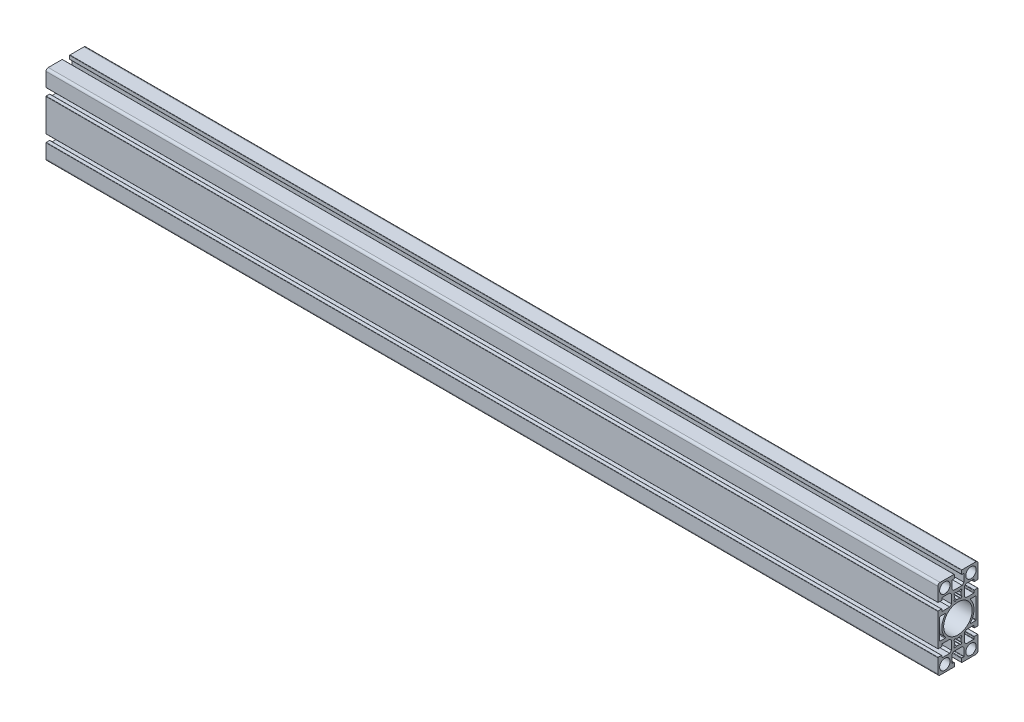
from build123d import *

# Parameters (mm, degrees)
MODEL6_R                                = 5.849999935
MODEL6_R_2                              = 15.999999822
F_45_SARJA_1_0109_45X90_VAHVA_L_1_DEPTH = 1000


with BuildPart() as part:
    # Model6 → 45-sarja 1.0109 45X90 VAHVA L_1 (new body)
    with BuildSketch(Plane(origin=(0, 0, 0), x_dir=(0, 0, -1), z_dir=(1, 0, 0))):
        with BuildLine():
            Line((4.599999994, 40.500001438), (6.499998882, 40.500001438))
            ThreePointArc((6.499998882, 40.500001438), (6.712130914, 40.412133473), (6.799998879, 40.200001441))
            Line((6.799998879, 40.200001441), (6.799998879, 31.699998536))
            Line((6.799998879, 31.699998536), (4.799998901, 29.699998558))
            Line((4.799998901, 29.699998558), (-4.799998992, 29.699998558))
            Line((-4.799998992, 29.699998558), (-6.79999997, 31.699998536))
            Line((-6.79999997, 31.699998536), (-6.79999997, 40.200001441))
            ThreePointArc((-6.79999997, 40.200001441), (-6.712132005, 40.412133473), (-6.499999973, 40.500001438))
            Line((-6.499999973, 40.500001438), (-4.599999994, 40.500001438))
            ThreePointArc((-4.599999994, 40.500001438), (-4.246446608, 40.646448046), (-4.1, 41.000001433))
            Line((-4.1, 41.000001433), (-4.1, 44.700001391))
            ThreePointArc((-4.1, 44.700001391), (-4.187867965, 44.912133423), (-4.399999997, 45.000001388))
            Line((-4.399999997, 45.000001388), (-20.000000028, 45.000001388))
            ThreePointArc((-20.000000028, 45.000001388), (-21.767766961, 44.267768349), (-22.5, 42.500001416))
            Line((-22.5, 42.500001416), (-22.5, 26.900001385))
            ThreePointArc((-22.5, 26.900001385), (-22.412132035, 26.687869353), (-22.200000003, 26.600001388))
            Line((-22.200000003, 26.600001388), (-18.500000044, 26.600001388))
            ThreePointArc((-18.500000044, 26.600001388), (-18.146446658, 26.746447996), (-18.00000005, 27.100001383))
            Line((-18.00000005, 27.100001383), (-18.00000005, 29.00000327))
            ThreePointArc((-18.00000005, 29.00000327), (-17.912132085, 29.212135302), (-17.700000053, 29.300003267))
            Line((-17.700000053, 29.300003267), (-9.200000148, 29.300003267))
            Line((-9.200000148, 29.300003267), (-7.20000017, 27.300003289))
            Line((-7.20000017, 27.300003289), (-7.20000017, 17.700001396))
            Line((-7.20000017, 17.700001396), (-9.200000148, 15.700001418))
            Line((-9.200000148, 15.700001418), (-17.700000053, 15.700001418))
            ThreePointArc((-17.700000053, 15.700001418), (-17.912132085, 15.787869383), (-18.00000005, 16.000001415))
            Line((-18.00000005, 16.000001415), (-18.00000005, 17.900001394))
            ThreePointArc((-18.00000005, 17.900001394), (-18.146446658, 18.25355478), (-18.500000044, 18.400001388))
            Line((-18.500000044, 18.400001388), (-22.200000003, 18.400001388))
            ThreePointArc((-22.200000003, 18.400001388), (-22.412132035, 18.312133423), (-22.5, 18.100001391))
            Line((-22.5, 18.100001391), (-22.5, -18.099998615))
            ThreePointArc((-22.5, -18.099998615), (-22.412132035, -18.312130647), (-22.200000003, -18.399998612))
            Line((-22.200000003, -18.399998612), (-18.500000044, -18.399998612))
            ThreePointArc((-18.500000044, -18.399998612), (-18.146446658, -18.253552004), (-18.00000005, -17.899998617))
            Line((-18.00000005, -17.899998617), (-18.00000005, -15.99999973))
            ThreePointArc((-18.00000005, -15.99999973), (-17.912132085, -15.787867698), (-17.700000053, -15.699999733))
            Line((-17.700000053, -15.699999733), (-9.200000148, -15.699999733))
            Line((-9.200000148, -15.699999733), (-7.20000017, -17.699999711))
            Line((-7.20000017, -17.699999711), (-7.20000017, -27.299997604))
            Line((-7.20000017, -27.299997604), (-9.200000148, -29.299998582))
            Line((-9.200000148, -29.299998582), (-17.700000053, -29.299998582))
            ThreePointArc((-17.700000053, -29.299998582), (-17.912132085, -29.212130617), (-18.00000005, -28.999998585))
            Line((-18.00000005, -28.999998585), (-18.00000005, -27.099998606))
            ThreePointArc((-18.00000005, -27.099998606), (-18.146446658, -26.74644522), (-18.500000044, -26.599998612))
            Line((-18.500000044, -26.599998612), (-22.200000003, -26.599998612))
            ThreePointArc((-22.200000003, -26.599998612), (-22.412132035, -26.687866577), (-22.5, -26.899998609))
            Line((-22.5, -26.899998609), (-22.5, -42.49999864))
            ThreePointArc((-22.5, -42.49999864), (-21.767766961, -44.267765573), (-20.000000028, -44.999998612))
            Line((-20.000000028, -44.999998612), (-4.399999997, -44.999998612))
            ThreePointArc((-4.399999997, -44.999998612), (-4.187867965, -44.912130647), (-4.1, -44.699998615))
            Line((-4.1, -44.699998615), (-4.1, -40.999998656))
            ThreePointArc((-4.1, -40.999998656), (-4.246446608, -40.64644527), (-4.599999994, -40.499998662))
            Line((-4.599999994, -40.499998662), (-6.499999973, -40.499998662))
            ThreePointArc((-6.499999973, -40.499998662), (-6.712132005, -40.412130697), (-6.79999997, -40.199998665))
            Line((-6.79999997, -40.199998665), (-6.79999997, -31.69999876))
            Line((-6.79999997, -31.69999876), (-4.799998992, -29.699998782))
            Line((-4.799998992, -29.699998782), (4.799998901, -29.699998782))
            Line((4.799998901, -29.699998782), (6.799998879, -31.69999876))
            Line((6.799998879, -31.69999876), (6.799998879, -40.199998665))
            ThreePointArc((6.799998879, -40.199998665), (6.712130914, -40.412130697), (6.499998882, -40.499998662))
            Line((6.499998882, -40.499998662), (4.599999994, -40.499998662))
            ThreePointArc((4.599999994, -40.499998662), (4.246446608, -40.64644527), (4.1, -40.999998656))
            Line((4.1, -40.999998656), (4.1, -44.699998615))
            ThreePointArc((4.1, -44.699998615), (4.187867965, -44.912130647), (4.399999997, -44.999998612))
            Line((4.399999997, -44.999998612), (20.000000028, -44.999998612))
            ThreePointArc((20.000000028, -44.999998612), (21.767766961, -44.267765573), (22.5, -42.49999864))
            Line((22.5, -42.49999864), (22.5, -26.899998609))
            ThreePointArc((22.5, -26.899998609), (22.412132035, -26.687866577), (22.200000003, -26.599998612))
            Line((22.200000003, -26.599998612), (18.500000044, -26.599998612))
            ThreePointArc((18.500000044, -26.599998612), (18.201741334, -26.66956742), (18.00000005, -26.899998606))
            Line((18.00000005, -26.899998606), (18.00000005, -28.799998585))
            ThreePointArc((18.00000005, -28.799998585), (17.912132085, -29.012130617), (17.700000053, -29.099998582))
            Line((17.700000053, -29.099998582), (9.200001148, -29.099998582))
            Line((9.200001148, -29.099998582), (7.20000117, -27.099997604))
            Line((7.20000117, -27.099997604), (7.20000117, -17.499999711))
            Line((7.20000117, -17.499999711), (9.200001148, -15.499999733))
            Line((9.200001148, -15.499999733), (17.700000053, -15.499999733))
            ThreePointArc((17.700000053, -15.499999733), (17.912132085, -15.587867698), (18.00000005, -15.79999973))
            Line((18.00000005, -15.79999973), (18.00000005, -17.699999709))
            ThreePointArc((18.00000005, -17.699999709), (18.050596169, -18.192430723), (18.500000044, -18.399998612))
            Line((18.500000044, -18.399998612), (22.200000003, -18.399998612))
            ThreePointArc((22.200000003, -18.399998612), (22.412132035, -18.312130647), (22.5, -18.099998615))
            Line((22.5, -18.099998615), (22.5, 18.100001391))
            ThreePointArc((22.5, 18.100001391), (22.412132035, 18.312133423), (22.200000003, 18.400001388))
            Line((22.200000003, 18.400001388), (18.500000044, 18.400001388))
            ThreePointArc((18.500000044, 18.400001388), (18.146446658, 18.25355478), (18.00000005, 17.900001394))
            Line((18.00000005, 17.900001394), (18.00000005, 16.000001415))
            ThreePointArc((18.00000005, 16.000001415), (17.912132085, 15.787869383), (17.700000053, 15.700001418))
            Line((17.700000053, 15.700001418), (9.200001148, 15.700001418))
            Line((9.200001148, 15.700001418), (7.20000117, 17.700001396))
            Line((7.20000117, 17.700001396), (7.20000117, 27.300003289))
            Line((7.20000117, 27.300003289), (9.200001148, 29.300003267))
            Line((9.200001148, 29.300003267), (17.700000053, 29.300003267))
            ThreePointArc((17.700000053, 29.300003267), (17.912132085, 29.212135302), (18.00000005, 29.00000327))
            Line((18.00000005, 29.00000327), (18.00000005, 27.100001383))
            ThreePointArc((18.00000005, 27.100001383), (18.146446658, 26.746447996), (18.500000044, 26.600001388))
            Line((18.500000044, 26.600001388), (22.200000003, 26.600001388))
            ThreePointArc((22.200000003, 26.600001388), (22.412132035, 26.687869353), (22.5, 26.900001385))
            Line((22.5, 26.900001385), (22.5, 42.500001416))
            ThreePointArc((22.5, 42.500001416), (21.767766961, 44.267768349), (20.000000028, 45.000001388))
            Line((20.000000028, 45.000001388), (4.399999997, 45.000001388))
            ThreePointArc((4.399999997, 45.000001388), (4.187867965, 44.912133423), (4.1, 44.700001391))
            Line((4.1, 44.700001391), (4.1, 41.000001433))
            ThreePointArc((4.1, 41.000001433), (4.246446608, 40.646448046), (4.599999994, 40.500001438))
        make_face()
        with Locations((-14.650000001, 37.150001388)):
            Circle(MODEL6_R, mode=Mode.SUBTRACT)
        Circle(MODEL6_R_2, mode=Mode.SUBTRACT)
        with Locations((14.65, -37.149998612)):
            Circle(MODEL6_R, mode=Mode.SUBTRACT)
        with Locations((-14.650000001, -37.149998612)):
            Circle(MODEL6_R, mode=Mode.SUBTRACT)
        with Locations((14.65, 37.150001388)):
            Circle(MODEL6_R, mode=Mode.SUBTRACT)
        with BuildLine():
            Line((1.949076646, 19.136709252), (2.969847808, 18.11593809))
            ThreePointArc((2.969847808, 18.11593809), (3.181979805, 18.02807014), (3.394111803, 18.11593809))
            Line((3.394111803, 18.11593809), (4.384061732, 19.105888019))
            ThreePointArc((4.384061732, 19.105888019), (4.471929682, 19.318020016), (4.384061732, 19.530152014))
            Line((4.384061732, 19.530152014), (3.363290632, 20.550923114))
            ThreePointArc((3.363290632, 20.550923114), (3.279575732, 20.713309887), (3.305579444, 20.894145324))
            ThreePointArc((3.305579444, 20.894145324), (3.674999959, 22.499999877), (3.305579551, 24.105854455))
            ThreePointArc((3.305579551, 24.105854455), (3.27957585, 24.286689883), (3.363290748, 24.449076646))
            Line((3.363290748, 24.449076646), (4.384062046, 25.469847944))
            ThreePointArc((4.384062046, 25.469847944), (4.471929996, 25.681979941), (4.384062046, 25.894111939))
            Line((4.384062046, 25.894111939), (3.394112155, 26.884061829))
            ThreePointArc((3.394112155, 26.884061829), (3.181980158, 26.97192978), (2.96984816, 26.884061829))
            Line((2.96984816, 26.884061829), (1.949076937, 25.863290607))
            ThreePointArc((1.949076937, 25.863290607), (1.786690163, 25.779575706), (1.605854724, 25.805579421))
            ThreePointArc((1.605854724, 25.805579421), (-4.86e-07, 26.174999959), (-1.605855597, 25.805578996))
            ThreePointArc((-1.605855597, 25.805578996), (-1.786691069, 25.779575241), (-1.949077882, 25.863290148))
            Line((-1.949077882, 25.863290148), (-2.969848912, 26.884061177))
            ThreePointArc((-2.969848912, 26.884061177), (-3.181980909, 26.971929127), (-3.394112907, 26.884061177))
            Line((-3.394112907, 26.884061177), (-4.384061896, 25.894112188))
            ThreePointArc((-4.384061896, 25.894112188), (-4.471929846, 25.68198019), (-4.384061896, 25.469848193))
            Line((-4.384061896, 25.469848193), (-3.363290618, 24.449076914))
            ThreePointArc((-3.363290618, 24.449076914), (-3.279575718, 24.286690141), (-3.305579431, 24.105854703))
            ThreePointArc((-3.305579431, 24.105854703), (-3.674999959, 22.499999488), (-3.305578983, 20.894144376))
            ThreePointArc((-3.305578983, 20.894144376), (-3.279575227, 20.713308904), (-3.363290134, 20.550922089))
            Line((-3.363290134, 20.550922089), (-4.384061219, 19.530151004))
            ThreePointArc((-4.384061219, 19.530151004), (-4.471929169, 19.318019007), (-4.384061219, 19.105887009))
            Line((-4.384061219, 19.105887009), (-3.39411223, 18.11593802))
            ThreePointArc((-3.39411223, 18.11593802), (-3.181980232, 18.02807007), (-2.969848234, 18.11593802))
            Line((-2.969848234, 18.11593802), (-1.949076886, 19.136709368))
            ThreePointArc((-1.949076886, 19.136709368), (-1.786690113, 19.220424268), (-1.605854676, 19.194420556))
            ThreePointArc((-1.605854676, 19.194420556), (-1.23e-07, 18.825000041), (1.605854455, 19.194420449))
            ThreePointArc((1.605854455, 19.194420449), (1.786689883, 19.22042415), (1.949076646, 19.136709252))
        make_face(mode=Mode.SUBTRACT)
        with BuildLine():
            Line((-3.39411223, -18.11593802), (-4.384061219, -19.105887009))
            ThreePointArc((-4.384061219, -19.105887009), (-4.471929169, -19.318019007), (-4.384061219, -19.530151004))
            Line((-4.384061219, -19.530151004), (-3.363290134, -20.550922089))
            ThreePointArc((-3.363290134, -20.550922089), (-3.279575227, -20.713308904), (-3.305578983, -20.894144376))
            ThreePointArc((-3.305578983, -20.894144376), (-3.674999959, -22.499999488), (-3.305579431, -24.105854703))
            ThreePointArc((-3.305579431, -24.105854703), (-3.279575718, -24.286690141), (-3.363290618, -24.449076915))
            Line((-3.363290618, -24.449076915), (-4.384061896, -25.469848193))
            ThreePointArc((-4.384061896, -25.469848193), (-4.471929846, -25.68198019), (-4.384061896, -25.894112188))
            Line((-4.384061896, -25.894112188), (-3.394112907, -26.884061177))
            ThreePointArc((-3.394112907, -26.884061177), (-3.181980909, -26.971929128), (-2.969848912, -26.884061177))
            Line((-2.969848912, -26.884061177), (-1.949077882, -25.863290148))
            ThreePointArc((-1.949077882, -25.863290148), (-1.786691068, -25.779575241), (-1.605855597, -25.805578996))
            ThreePointArc((-1.605855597, -25.805578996), (-4.86e-07, -26.174999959), (1.605854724, -25.805579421))
            ThreePointArc((1.605854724, -25.805579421), (1.786690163, -25.779575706), (1.949076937, -25.863290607))
            Line((1.949076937, -25.863290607), (2.96984816, -26.884061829))
            ThreePointArc((2.96984816, -26.884061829), (3.181980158, -26.97192978), (3.394112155, -26.884061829))
            Line((3.394112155, -26.884061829), (4.384062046, -25.894111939))
            ThreePointArc((4.384062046, -25.894111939), (4.471929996, -25.681979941), (4.384062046, -25.469847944))
            Line((4.384062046, -25.469847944), (3.363290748, -24.449076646))
            ThreePointArc((3.363290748, -24.449076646), (3.27957585, -24.286689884), (3.305579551, -24.105854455))
            ThreePointArc((3.305579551, -24.105854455), (3.674999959, -22.499999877), (3.305579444, -20.894145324))
            ThreePointArc((3.305579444, -20.894145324), (3.279575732, -20.713309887), (3.363290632, -20.550923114))
            Line((3.363290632, -20.550923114), (4.384061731, -19.530152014))
            ThreePointArc((4.384061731, -19.530152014), (4.471929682, -19.318020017), (4.384061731, -19.105888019))
            Line((4.384061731, -19.105888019), (3.394111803, -18.11593809))
            ThreePointArc((3.394111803, -18.11593809), (3.181979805, -18.02807014), (2.969847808, -18.11593809))
            Line((2.969847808, -18.11593809), (1.949076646, -19.136709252))
            ThreePointArc((1.949076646, -19.136709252), (1.786689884, -19.22042415), (1.605854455, -19.194420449))
            ThreePointArc((1.605854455, -19.194420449), (-1.23e-07, -18.825000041), (-1.605854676, -19.194420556))
            ThreePointArc((-1.605854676, -19.194420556), (-1.786690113, -19.220424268), (-1.949076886, -19.136709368))
            Line((-1.949076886, -19.136709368), (-2.969848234, -18.11593802))
            ThreePointArc((-2.969848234, -18.11593802), (-3.181980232, -18.02807007), (-3.39411223, -18.11593802))
        make_face(mode=Mode.SUBTRACT)
        with BuildLine():
            Line((-20.5, 11.5), (-20.5, -11.5))
            ThreePointArc((-20.5, -11.5), (-20.353553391, -11.853553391), (-20, -12))
            Line((-20, -12), (-14.491376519, -12))
            ThreePointArc((-14.491376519, -12), (-14.04115135, -11.717479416), (-14.099717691, -11.189189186))
            ThreePointArc((-14.099717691, -11.189189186), (-17.999999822, 0), (-14.099717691, 11.189189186))
            ThreePointArc((-14.099717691, 11.189189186), (-14.04115135, 11.717479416), (-14.491376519, 12))
            Line((-14.491376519, 12), (-20, 12))
            ThreePointArc((-20, 12), (-20.353553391, 11.853553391), (-20.5, 11.5))
        make_face(mode=Mode.SUBTRACT)
        with BuildLine():
            Line((20.5, 11.499998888), (20.5, -11.500001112))
            ThreePointArc((20.5, -11.500001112), (20.353553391, -11.853554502), (20, -12.000001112))
            Line((20, -12.000001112), (14.491375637, -12.000001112))
            ThreePointArc((14.491375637, -12.000001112), (14.041150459, -11.717480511), (14.099716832, -11.189190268))
            ThreePointArc((14.099716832, -11.189190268), (17.999999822, -1.381e-06), (14.099718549, 11.189188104))
            ThreePointArc((14.099718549, 11.189188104), (14.04115224, 11.717478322), (14.491377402, 11.999998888))
            Line((14.491377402, 11.999998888), (20, 11.999998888))
            ThreePointArc((20, 11.999998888), (20.353553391, 11.853552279), (20.5, 11.499998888))
        make_face(mode=Mode.SUBTRACT)
    extrude(amount=F_45_SARJA_1_0109_45X90_VAHVA_L_1_DEPTH)


solid = part.part
